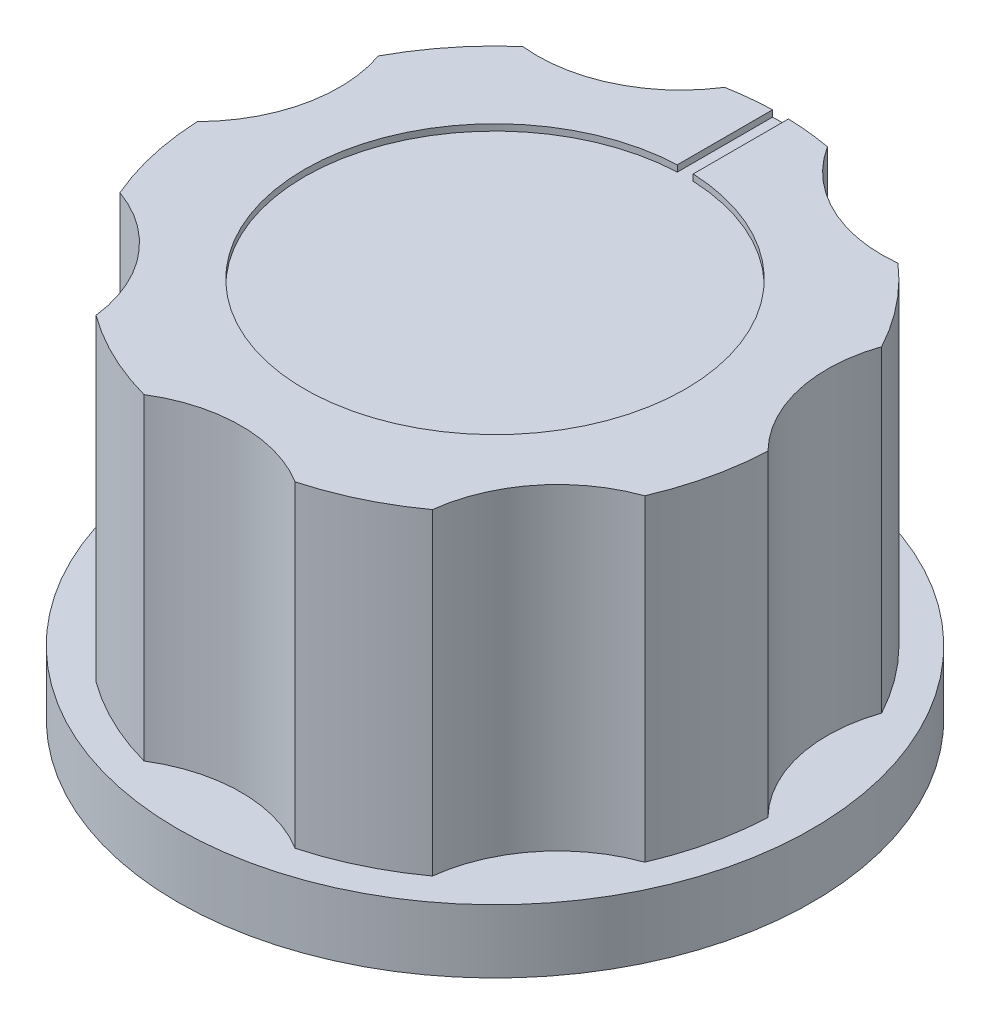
ISO-10303-21;
HEADER;
FILE_DESCRIPTION(('STEP AP214'),'2;1');
FILE_NAME('part.step','',(''),(''),'','','');
FILE_SCHEMA(('AUTOMOTIVE_DESIGN { 1 0 10303 214 1 1 1 1 }'));
ENDSEC;
DATA;
#1=APPLICATION_CONTEXT('core data for automotive mechanical design processes');
#2=APPLICATION_PROTOCOL_DEFINITION('international standard','automotive_design',2000,#1);
#3=PRODUCT_CONTEXT('',#1,'mechanical');
#4=PRODUCT('Part','Part','',(#3));
#5=PRODUCT_RELATED_PRODUCT_CATEGORY('part','',(#4));
#6=PRODUCT_DEFINITION_FORMATION('','',#4);
#7=PRODUCT_DEFINITION_CONTEXT('part definition',#1,'design');
#8=PRODUCT_DEFINITION('design','',#6,#7);
#9=PRODUCT_DEFINITION_SHAPE('','',#8);
#10=(LENGTH_UNIT() NAMED_UNIT(*) SI_UNIT(.MILLI.,.METRE.));
#11=(NAMED_UNIT(*) PLANE_ANGLE_UNIT() SI_UNIT($,.RADIAN.));
#12=(NAMED_UNIT(*) SI_UNIT($,.STERADIAN.) SOLID_ANGLE_UNIT());
#13=UNCERTAINTY_MEASURE_WITH_UNIT(LENGTH_MEASURE(1.E-05),#10,'distance_accuracy_value','');
#14=(GEOMETRIC_REPRESENTATION_CONTEXT(3) GLOBAL_UNCERTAINTY_ASSIGNED_CONTEXT((#13)) GLOBAL_UNIT_ASSIGNED_CONTEXT((#10,
#11,#12)) REPRESENTATION_CONTEXT('',''));
#15=CARTESIAN_POINT('',(0.,0.,0.));
#16=DIRECTION('',(0.,0.,1.));
#17=DIRECTION('',(1.,0.,0.));
#18=AXIS2_PLACEMENT_3D('',#15,#16,#17);
#19=CARTESIAN_POINT('',(10.,2.,0.));
#20=DIRECTION('',(0.,1.,0.));
#21=DIRECTION('',(0.,0.,1.));
#22=AXIS2_PLACEMENT_3D('',#19,#20,#21);
#23=PLANE('',#22);
#24=CARTESIAN_POINT('',(0.,2.,0.));
#25=DIRECTION('',(0.,-1.,0.));
#26=DIRECTION('',(0.,0.,-1.));
#27=AXIS2_PLACEMENT_3D('',#24,#25,#26);
#28=CIRCLE('',#27,10.);
#29=CARTESIAN_POINT('',(0.,2.,-10.));
#30=VERTEX_POINT('',#29);
#31=EDGE_CURVE('E11',#30,#30,#28,.T.);
#32=ORIENTED_EDGE('',*,*,#31,.F.);
#33=EDGE_LOOP('',(#32));
#34=FACE_BOUND('',#33,.T.);
#35=CARTESIAN_POINT('',(-5.42751087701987,2.,-11.2747237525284));
#36=DIRECTION('',(0.,-1.,0.));
#37=DIRECTION('',(0.,0.,1.));
#38=AXIS2_PLACEMENT_3D('',#35,#36,#37);
#39=CIRCLE('',#38,4.51351769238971);
#40=CARTESIAN_POINT('',(-1.61852102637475,2.,-8.85326999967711));
#41=VERTEX_POINT('',#40);
#42=CARTESIAN_POINT('',(-5.91057194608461,2.,-6.78713041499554));
#43=VERTEX_POINT('',#42);
#44=EDGE_CURVE('E220',#41,#43,#39,.T.);
#45=ORIENTED_EDGE('',*,*,#44,.F.);
#46=CARTESIAN_POINT('',(0.,2.,0.));
#47=DIRECTION('',(0.,1.,0.));
#48=DIRECTION('',(0.,0.,-1.));
#49=AXIS2_PLACEMENT_3D('',#46,#47,#48);
#50=CIRCLE('',#49,9.);
#51=CARTESIAN_POINT('',(1.6221993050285,2.,-8.85259676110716));
#52=VERTEX_POINT('',#51);
#53=EDGE_CURVE('E217',#52,#41,#50,.T.);
#54=ORIENTED_EDGE('',*,*,#53,.F.);
#55=CARTESIAN_POINT('',(5.43131281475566,2.,-11.2738559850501));
#56=DIRECTION('',(0.,-1.,0.));
#57=DIRECTION('',(0.,0.,1.));
#58=AXIS2_PLACEMENT_3D('',#55,#56,#57);
#59=CIRCLE('',#58,4.51351769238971);
#60=CARTESIAN_POINT('',(5.91187609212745,2.,-6.78599447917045));
#61=VERTEX_POINT('',#60);
#62=EDGE_CURVE('E245',#61,#52,#59,.T.);
#63=ORIENTED_EDGE('',*,*,#62,.F.);
#64=CARTESIAN_POINT('',(0.,2.,0.));
#65=DIRECTION('',(0.,1.,0.));
#66=DIRECTION('',(0.,0.,-1.));
#67=AXIS2_PLACEMENT_3D('',#64,#65,#66);
#68=CIRCLE('',#67,9.);
#69=CARTESIAN_POINT('',(7.93272911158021,2.,-4.25109501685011));
#70=VERTEX_POINT('',#69);
#71=EDGE_CURVE('E243',#70,#61,#68,.T.);
#72=ORIENTED_EDGE('',*,*,#71,.F.);
#73=CARTESIAN_POINT('',(12.2010001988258,2.,-2.78354471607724));
#74=DIRECTION('',(0.,-1.,0.));
#75=DIRECTION('',(0.,0.,1.));
#76=AXIS2_PLACEMENT_3D('',#73,#74,#75);
#77=CIRCLE('',#76,4.51351769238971);
#78=CARTESIAN_POINT('',(8.99154694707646,2.,0.389978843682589));
#79=VERTEX_POINT('',#78);
#80=EDGE_CURVE('E241',#79,#70,#77,.T.);
#81=ORIENTED_EDGE('',*,*,#80,.F.);
#82=CARTESIAN_POINT('',(0.,2.,0.));
#83=DIRECTION('',(0.,1.,0.));
#84=DIRECTION('',(0.,0.,-1.));
#85=AXIS2_PLACEMENT_3D('',#82,#83,#84);
#86=CIRCLE('',#85,9.);
#87=CARTESIAN_POINT('',(8.26994399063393,2.,3.55077827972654));
#88=VERTEX_POINT('',#87);
#89=EDGE_CURVE('E239',#88,#79,#86,.T.);
#90=ORIENTED_EDGE('',*,*,#89,.F.);
#91=CARTESIAN_POINT('',(9.78383859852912,2.,7.80283249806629));
#92=DIRECTION('',(0.,-1.,0.));
#93=DIRECTION('',(0.,0.,1.));
#94=AXIS2_PLACEMENT_3D('',#91,#92,#93);
#95=CIRCLE('',#94,4.51351769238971);
#96=CARTESIAN_POINT('',(5.30155090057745,2.,7.27279575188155));
#97=VERTEX_POINT('',#96);
#98=EDGE_CURVE('E237',#97,#88,#95,.T.);
#99=ORIENTED_EDGE('',*,*,#98,.F.);
#100=CARTESIAN_POINT('',(0.,2.,0.));
#101=DIRECTION('',(0.,1.,0.));
#102=DIRECTION('',(0.,0.,-1.));
#103=AXIS2_PLACEMENT_3D('',#100,#101,#102);
#104=CIRCLE('',#103,9.);
#105=CARTESIAN_POINT('',(2.38125,2.,8.67926543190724));
#106=VERTEX_POINT('',#105);
#107=EDGE_CURVE('E235',#106,#97,#104,.T.);
#108=ORIENTED_EDGE('',*,*,#107,.F.);
#109=CARTESIAN_POINT('',(0.,2.,12.5135176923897));
#110=DIRECTION('',(0.,-1.,0.));
#111=DIRECTION('',(0.,0.,1.));
#112=AXIS2_PLACEMENT_3D('',#109,#110,#111);
#113=CIRCLE('',#112,4.51351769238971);
#114=CARTESIAN_POINT('',(-2.38125,2.,8.67926543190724));
#115=VERTEX_POINT('',#114);
#116=EDGE_CURVE('E233',#115,#106,#113,.T.);
#117=ORIENTED_EDGE('',*,*,#116,.F.);
#118=CARTESIAN_POINT('',(0.,2.,0.));
#119=DIRECTION('',(0.,1.,0.));
#120=DIRECTION('',(0.,0.,-1.));
#121=AXIS2_PLACEMENT_3D('',#118,#119,#120);
#122=CIRCLE('',#121,9.);
#123=CARTESIAN_POINT('',(-5.30052517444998,2.,7.27354335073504));
#124=VERTEX_POINT('',#123);
#125=EDGE_CURVE('E231',#124,#115,#122,.T.);
#126=ORIENTED_EDGE('',*,*,#125,.F.);
#127=CARTESIAN_POINT('',(-9.78308557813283,2.,7.80126883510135));
#128=DIRECTION('',(0.,-1.,0.));
#129=DIRECTION('',(0.,0.,1.));
#130=AXIS2_PLACEMENT_3D('',#127,#128,#129);
#131=CIRCLE('',#130,4.51351769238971);
#132=CARTESIAN_POINT('',(-8.27087181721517,2.,3.5486165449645));
#133=VERTEX_POINT('',#132);
#134=EDGE_CURVE('E229',#133,#124,#131,.T.);
#135=ORIENTED_EDGE('',*,*,#134,.F.);
#136=CARTESIAN_POINT('',(0.,2.,0.));
#137=DIRECTION('',(0.,1.,0.));
#138=DIRECTION('',(0.,0.,-1.));
#139=AXIS2_PLACEMENT_3D('',#136,#137,#138);
#140=CIRCLE('',#139,9.);
#141=CARTESIAN_POINT('',(-8.99152528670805,2.,0.390477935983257));
#142=VERTEX_POINT('',#141);
#143=EDGE_CURVE('E227',#142,#133,#140,.T.);
#144=ORIENTED_EDGE('',*,*,#143,.F.);
#145=CARTESIAN_POINT('',(-12.1985551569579,2.,-2.7854945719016));
#146=DIRECTION('',(0.,-1.,0.));
#147=DIRECTION('',(0.,0.,1.));
#148=AXIS2_PLACEMENT_3D('',#145,#146,#147);
#149=CIRCLE('',#148,4.51351769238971);
#150=CARTESIAN_POINT('',(-7.93083109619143,2.,-4.25463489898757));
#151=VERTEX_POINT('',#150);
#152=EDGE_CURVE('E225',#151,#142,#149,.T.);
#153=ORIENTED_EDGE('',*,*,#152,.F.);
#154=CARTESIAN_POINT('',(0.,2.,0.));
#155=DIRECTION('',(0.,1.,0.));
#156=DIRECTION('',(0.,0.,-1.));
#157=AXIS2_PLACEMENT_3D('',#154,#155,#156);
#158=CIRCLE('',#157,9.);
#159=EDGE_CURVE('E223',#43,#151,#158,.T.);
#160=ORIENTED_EDGE('',*,*,#159,.F.);
#161=EDGE_LOOP('',(#45,#54,#63,#72,#81,#90,#99,#108,#117,#126,#135,#144,#153,#160));
#162=FACE_BOUND('',#161,.T.);
#163=ADVANCED_FACE('F33',(#34,#162),#23,.T.);
#164=CARTESIAN_POINT('',(0.,2.,0.));
#165=DIRECTION('',(0.,-1.,0.));
#166=DIRECTION('',(0.,0.,-1.));
#167=AXIS2_PLACEMENT_3D('',#164,#165,#166);
#168=CYLINDRICAL_SURFACE('',#167,10.);
#169=ORIENTED_EDGE('',*,*,#31,.T.);
#170=EDGE_LOOP('',(#169));
#171=FACE_BOUND('',#170,.T.);
#172=CARTESIAN_POINT('',(0.,0.,0.));
#173=DIRECTION('',(0.,-1.,0.));
#174=DIRECTION('',(0.,0.,-1.));
#175=AXIS2_PLACEMENT_3D('',#172,#173,#174);
#176=CIRCLE('',#175,10.);
#177=CARTESIAN_POINT('',(0.,0.,-10.));
#178=VERTEX_POINT('',#177);
#179=EDGE_CURVE('E41',#178,#178,#176,.T.);
#180=ORIENTED_EDGE('',*,*,#179,.F.);
#181=EDGE_LOOP('',(#180));
#182=FACE_BOUND('',#181,.T.);
#183=ADVANCED_FACE('F35',(#171,#182),#168,.T.);
#184=CARTESIAN_POINT('',(0.,0.,0.));
#185=DIRECTION('',(0.,-1.,0.));
#186=DIRECTION('',(0.,0.,-1.));
#187=AXIS2_PLACEMENT_3D('',#184,#185,#186);
#188=PLANE('',#187);
#189=CARTESIAN_POINT('',(0.,0.,0.));
#190=DIRECTION('',(0.,-1.,0.));
#191=DIRECTION('',(0.,0.,-1.));
#192=AXIS2_PLACEMENT_3D('',#189,#190,#191);
#193=CIRCLE('',#192,6.5);
#194=CARTESIAN_POINT('',(0.,0.,-6.5));
#195=VERTEX_POINT('',#194);
#196=EDGE_CURVE('E567',#195,#195,#193,.T.);
#197=ORIENTED_EDGE('',*,*,#196,.F.);
#198=EDGE_LOOP('',(#197));
#199=FACE_BOUND('',#198,.T.);
#200=ORIENTED_EDGE('',*,*,#179,.T.);
#201=EDGE_LOOP('',(#200));
#202=FACE_BOUND('',#201,.T.);
#203=ADVANCED_FACE('F287',(#199,#202),#188,.T.);
#204=CARTESIAN_POINT('',(0.,12.,0.));
#205=DIRECTION('',(0.,-1.,0.));
#206=DIRECTION('',(0.,0.,-1.));
#207=AXIS2_PLACEMENT_3D('',#204,#205,#206);
#208=CYLINDRICAL_SURFACE('',#207,9.);
#209=CARTESIAN_POINT('',(0.,11.8,0.));
#210=DIRECTION('',(0.,1.,0.));
#211=DIRECTION('',(0.,0.,1.));
#212=AXIS2_PLACEMENT_3D('',#209,#210,#211);
#213=CIRCLE('',#212,9.);
#214=CARTESIAN_POINT('',(0.249999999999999,11.8,-8.99652710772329));
#215=VERTEX_POINT('',#214);
#216=CARTESIAN_POINT('',(-0.25,11.8,-8.99652710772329));
#217=VERTEX_POINT('',#216);
#218=EDGE_CURVE('E166',#215,#217,#213,.T.);
#219=ORIENTED_EDGE('',*,*,#218,.F.);
#220=DIRECTION('',(0.,1.,0.));
#221=VECTOR('',#220,1.);
#222=CARTESIAN_POINT('',(0.249999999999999,11.8,-8.99652710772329));
#223=LINE('',#222,#221);
#224=CARTESIAN_POINT('',(0.249999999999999,12.,-8.99652710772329));
#225=VERTEX_POINT('',#224);
#226=EDGE_CURVE('E221',#215,#225,#223,.T.);
#227=ORIENTED_EDGE('',*,*,#226,.T.);
#228=CARTESIAN_POINT('',(0.,12.,0.));
#229=DIRECTION('',(0.,1.,0.));
#230=DIRECTION('',(0.,0.,-1.));
#231=AXIS2_PLACEMENT_3D('',#228,#229,#230);
#232=CIRCLE('',#231,9.);
#233=CARTESIAN_POINT('',(1.6221993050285,12.,-8.85259676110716));
#234=VERTEX_POINT('',#233);
#235=EDGE_CURVE('E187',#234,#225,#232,.T.);
#236=ORIENTED_EDGE('',*,*,#235,.F.);
#237=DIRECTION('',(0.,-1.,0.));
#238=VECTOR('',#237,1.);
#239=CARTESIAN_POINT('',(1.6221993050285,12.,-8.85259676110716));
#240=LINE('',#239,#238);
#241=EDGE_CURVE('E216',#234,#52,#240,.T.);
#242=ORIENTED_EDGE('',*,*,#241,.T.);
#243=ORIENTED_EDGE('',*,*,#53,.T.);
#244=DIRECTION('',(0.,-1.,0.));
#245=VECTOR('',#244,1.);
#246=CARTESIAN_POINT('',(-1.61852102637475,12.,-8.85326999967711));
#247=LINE('',#246,#245);
#248=CARTESIAN_POINT('',(-1.61852102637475,12.,-8.85326999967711));
#249=VERTEX_POINT('',#248);
#250=EDGE_CURVE('E283',#249,#41,#247,.T.);
#251=ORIENTED_EDGE('',*,*,#250,.F.);
#252=CARTESIAN_POINT('',(-0.25,12.,-8.99652710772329));
#253=VERTEX_POINT('',#252);
#254=EDGE_CURVE('E180',#253,#249,#232,.T.);
#255=ORIENTED_EDGE('',*,*,#254,.F.);
#256=DIRECTION('',(0.,1.,0.));
#257=VECTOR('',#256,1.);
#258=CARTESIAN_POINT('',(-0.25,11.8,-8.99652710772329));
#259=LINE('',#258,#257);
#260=EDGE_CURVE('E48',#217,#253,#259,.T.);
#261=ORIENTED_EDGE('',*,*,#260,.F.);
#262=EDGE_LOOP('',(#219,#227,#236,#242,#243,#251,#255,#261));
#263=FACE_BOUND('',#262,.T.);
#264=ADVANCED_FACE('F178',(#263),#208,.T.);
#265=CARTESIAN_POINT('',(-5.42751087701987,12.,-11.2747237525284));
#266=DIRECTION('',(0.,-1.,0.));
#267=DIRECTION('',(0.,0.,-1.));
#268=AXIS2_PLACEMENT_3D('',#265,#266,#267);
#269=CYLINDRICAL_SURFACE('',#268,4.51351769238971);
#270=ORIENTED_EDGE('',*,*,#44,.T.);
#271=DIRECTION('',(0.,-1.,0.));
#272=VECTOR('',#271,1.);
#273=CARTESIAN_POINT('',(-5.91057194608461,12.,-6.78713041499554));
#274=LINE('',#273,#272);
#275=CARTESIAN_POINT('',(-5.91057194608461,12.,-6.78713041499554));
#276=VERTEX_POINT('',#275);
#277=EDGE_CURVE('E280',#276,#43,#274,.T.);
#278=ORIENTED_EDGE('',*,*,#277,.F.);
#279=CARTESIAN_POINT('',(-5.42751087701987,12.,-11.2747237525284));
#280=DIRECTION('',(0.,-1.,0.));
#281=DIRECTION('',(0.,0.,1.));
#282=AXIS2_PLACEMENT_3D('',#279,#280,#281);
#283=CIRCLE('',#282,4.51351769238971);
#284=EDGE_CURVE('E190',#249,#276,#283,.T.);
#285=ORIENTED_EDGE('',*,*,#284,.F.);
#286=ORIENTED_EDGE('',*,*,#250,.T.);
#287=EDGE_LOOP('',(#270,#278,#285,#286));
#288=FACE_BOUND('',#287,.T.);
#289=ADVANCED_FACE('F307',(#288),#269,.F.);
#290=CARTESIAN_POINT('',(0.,12.,0.));
#291=DIRECTION('',(0.,-1.,0.));
#292=DIRECTION('',(0.,0.,-1.));
#293=AXIS2_PLACEMENT_3D('',#290,#291,#292);
#294=CYLINDRICAL_SURFACE('',#293,9.);
#295=ORIENTED_EDGE('',*,*,#159,.T.);
#296=DIRECTION('',(0.,-1.,0.));
#297=VECTOR('',#296,1.);
#298=CARTESIAN_POINT('',(-7.93083109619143,12.,-4.25463489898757));
#299=LINE('',#298,#297);
#300=CARTESIAN_POINT('',(-7.93083109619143,12.,-4.25463489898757));
#301=VERTEX_POINT('',#300);
#302=EDGE_CURVE('E277',#301,#151,#299,.T.);
#303=ORIENTED_EDGE('',*,*,#302,.F.);
#304=CARTESIAN_POINT('',(0.,12.,0.));
#305=DIRECTION('',(0.,1.,0.));
#306=DIRECTION('',(0.,0.,-1.));
#307=AXIS2_PLACEMENT_3D('',#304,#305,#306);
#308=CIRCLE('',#307,9.);
#309=EDGE_CURVE('E192',#276,#301,#308,.T.);
#310=ORIENTED_EDGE('',*,*,#309,.F.);
#311=ORIENTED_EDGE('',*,*,#277,.T.);
#312=EDGE_LOOP('',(#295,#303,#310,#311));
#313=FACE_BOUND('',#312,.T.);
#314=ADVANCED_FACE('F311',(#313),#294,.T.);
#315=CARTESIAN_POINT('',(-12.1985551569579,12.,-2.7854945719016));
#316=DIRECTION('',(0.,-1.,0.));
#317=DIRECTION('',(0.,0.,-1.));
#318=AXIS2_PLACEMENT_3D('',#315,#316,#317);
#319=CYLINDRICAL_SURFACE('',#318,4.51351769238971);
#320=ORIENTED_EDGE('',*,*,#152,.T.);
#321=DIRECTION('',(0.,-1.,0.));
#322=VECTOR('',#321,1.);
#323=CARTESIAN_POINT('',(-8.99152528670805,12.,0.390477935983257));
#324=LINE('',#323,#322);
#325=CARTESIAN_POINT('',(-8.99152528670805,12.,0.390477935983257));
#326=VERTEX_POINT('',#325);
#327=EDGE_CURVE('E274',#326,#142,#324,.T.);
#328=ORIENTED_EDGE('',*,*,#327,.F.);
#329=CARTESIAN_POINT('',(-12.1985551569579,12.,-2.7854945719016));
#330=DIRECTION('',(0.,-1.,0.));
#331=DIRECTION('',(0.,0.,1.));
#332=AXIS2_PLACEMENT_3D('',#329,#330,#331);
#333=CIRCLE('',#332,4.51351769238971);
#334=EDGE_CURVE('E194',#301,#326,#333,.T.);
#335=ORIENTED_EDGE('',*,*,#334,.F.);
#336=ORIENTED_EDGE('',*,*,#302,.T.);
#337=EDGE_LOOP('',(#320,#328,#335,#336));
#338=FACE_BOUND('',#337,.T.);
#339=ADVANCED_FACE('F365',(#338),#319,.F.);
#340=CARTESIAN_POINT('',(0.,12.,0.));
#341=DIRECTION('',(0.,-1.,0.));
#342=DIRECTION('',(0.,0.,-1.));
#343=AXIS2_PLACEMENT_3D('',#340,#341,#342);
#344=CYLINDRICAL_SURFACE('',#343,9.);
#345=ORIENTED_EDGE('',*,*,#143,.T.);
#346=DIRECTION('',(0.,-1.,0.));
#347=VECTOR('',#346,1.);
#348=CARTESIAN_POINT('',(-8.27087181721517,12.,3.5486165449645));
#349=LINE('',#348,#347);
#350=CARTESIAN_POINT('',(-8.27087181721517,12.,3.5486165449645));
#351=VERTEX_POINT('',#350);
#352=EDGE_CURVE('E271',#351,#133,#349,.T.);
#353=ORIENTED_EDGE('',*,*,#352,.F.);
#354=CARTESIAN_POINT('',(0.,12.,0.));
#355=DIRECTION('',(0.,1.,0.));
#356=DIRECTION('',(0.,0.,-1.));
#357=AXIS2_PLACEMENT_3D('',#354,#355,#356);
#358=CIRCLE('',#357,9.);
#359=EDGE_CURVE('E196',#326,#351,#358,.T.);
#360=ORIENTED_EDGE('',*,*,#359,.F.);
#361=ORIENTED_EDGE('',*,*,#327,.T.);
#362=EDGE_LOOP('',(#345,#353,#360,#361));
#363=FACE_BOUND('',#362,.T.);
#364=ADVANCED_FACE('F363',(#363),#344,.T.);
#365=CARTESIAN_POINT('',(-9.78308557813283,12.,7.80126883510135));
#366=DIRECTION('',(0.,-1.,0.));
#367=DIRECTION('',(0.,0.,-1.));
#368=AXIS2_PLACEMENT_3D('',#365,#366,#367);
#369=CYLINDRICAL_SURFACE('',#368,4.51351769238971);
#370=ORIENTED_EDGE('',*,*,#134,.T.);
#371=DIRECTION('',(0.,-1.,0.));
#372=VECTOR('',#371,1.);
#373=CARTESIAN_POINT('',(-5.30052517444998,12.,7.27354335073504));
#374=LINE('',#373,#372);
#375=CARTESIAN_POINT('',(-5.30052517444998,12.,7.27354335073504));
#376=VERTEX_POINT('',#375);
#377=EDGE_CURVE('E268',#376,#124,#374,.T.);
#378=ORIENTED_EDGE('',*,*,#377,.F.);
#379=CARTESIAN_POINT('',(-9.78308557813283,12.,7.80126883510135));
#380=DIRECTION('',(0.,-1.,0.));
#381=DIRECTION('',(0.,0.,1.));
#382=AXIS2_PLACEMENT_3D('',#379,#380,#381);
#383=CIRCLE('',#382,4.51351769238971);
#384=EDGE_CURVE('E198',#351,#376,#383,.T.);
#385=ORIENTED_EDGE('',*,*,#384,.F.);
#386=ORIENTED_EDGE('',*,*,#352,.T.);
#387=EDGE_LOOP('',(#370,#378,#385,#386));
#388=FACE_BOUND('',#387,.T.);
#389=ADVANCED_FACE('F359',(#388),#369,.F.);
#390=CARTESIAN_POINT('',(0.,12.,0.));
#391=DIRECTION('',(0.,-1.,0.));
#392=DIRECTION('',(0.,0.,-1.));
#393=AXIS2_PLACEMENT_3D('',#390,#391,#392);
#394=CYLINDRICAL_SURFACE('',#393,9.);
#395=ORIENTED_EDGE('',*,*,#125,.T.);
#396=DIRECTION('',(0.,-1.,0.));
#397=VECTOR('',#396,1.);
#398=CARTESIAN_POINT('',(-2.38125,12.,8.67926543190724));
#399=LINE('',#398,#397);
#400=CARTESIAN_POINT('',(-2.38125,12.,8.67926543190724));
#401=VERTEX_POINT('',#400);
#402=EDGE_CURVE('E265',#401,#115,#399,.T.);
#403=ORIENTED_EDGE('',*,*,#402,.F.);
#404=CARTESIAN_POINT('',(0.,12.,0.));
#405=DIRECTION('',(0.,1.,0.));
#406=DIRECTION('',(0.,0.,-1.));
#407=AXIS2_PLACEMENT_3D('',#404,#405,#406);
#408=CIRCLE('',#407,9.);
#409=EDGE_CURVE('E200',#376,#401,#408,.T.);
#410=ORIENTED_EDGE('',*,*,#409,.F.);
#411=ORIENTED_EDGE('',*,*,#377,.T.);
#412=EDGE_LOOP('',(#395,#403,#410,#411));
#413=FACE_BOUND('',#412,.T.);
#414=ADVANCED_FACE('F354',(#413),#394,.T.);
#415=CARTESIAN_POINT('',(0.,12.,12.5135176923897));
#416=DIRECTION('',(0.,-1.,0.));
#417=DIRECTION('',(0.,0.,-1.));
#418=AXIS2_PLACEMENT_3D('',#415,#416,#417);
#419=CYLINDRICAL_SURFACE('',#418,4.51351769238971);
#420=ORIENTED_EDGE('',*,*,#116,.T.);
#421=DIRECTION('',(0.,-1.,0.));
#422=VECTOR('',#421,1.);
#423=CARTESIAN_POINT('',(2.38125,12.,8.67926543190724));
#424=LINE('',#423,#422);
#425=CARTESIAN_POINT('',(2.38125,12.,8.67926543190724));
#426=VERTEX_POINT('',#425);
#427=EDGE_CURVE('E262',#426,#106,#424,.T.);
#428=ORIENTED_EDGE('',*,*,#427,.F.);
#429=CARTESIAN_POINT('',(0.,12.,12.5135176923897));
#430=DIRECTION('',(0.,-1.,0.));
#431=DIRECTION('',(0.,0.,1.));
#432=AXIS2_PLACEMENT_3D('',#429,#430,#431);
#433=CIRCLE('',#432,4.51351769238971);
#434=EDGE_CURVE('E202',#401,#426,#433,.T.);
#435=ORIENTED_EDGE('',*,*,#434,.F.);
#436=ORIENTED_EDGE('',*,*,#402,.T.);
#437=EDGE_LOOP('',(#420,#428,#435,#436));
#438=FACE_BOUND('',#437,.T.);
#439=ADVANCED_FACE('F348',(#438),#419,.F.);
#440=CARTESIAN_POINT('',(0.,12.,0.));
#441=DIRECTION('',(0.,-1.,0.));
#442=DIRECTION('',(0.,0.,-1.));
#443=AXIS2_PLACEMENT_3D('',#440,#441,#442);
#444=CYLINDRICAL_SURFACE('',#443,9.);
#445=ORIENTED_EDGE('',*,*,#107,.T.);
#446=DIRECTION('',(0.,-1.,0.));
#447=VECTOR('',#446,1.);
#448=CARTESIAN_POINT('',(5.30155090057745,12.,7.27279575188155));
#449=LINE('',#448,#447);
#450=CARTESIAN_POINT('',(5.30155090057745,12.,7.27279575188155));
#451=VERTEX_POINT('',#450);
#452=EDGE_CURVE('E259',#451,#97,#449,.T.);
#453=ORIENTED_EDGE('',*,*,#452,.F.);
#454=CARTESIAN_POINT('',(0.,12.,0.));
#455=DIRECTION('',(0.,1.,0.));
#456=DIRECTION('',(0.,0.,-1.));
#457=AXIS2_PLACEMENT_3D('',#454,#455,#456);
#458=CIRCLE('',#457,9.);
#459=EDGE_CURVE('E204',#426,#451,#458,.T.);
#460=ORIENTED_EDGE('',*,*,#459,.F.);
#461=ORIENTED_EDGE('',*,*,#427,.T.);
#462=EDGE_LOOP('',(#445,#453,#460,#461));
#463=FACE_BOUND('',#462,.T.);
#464=ADVANCED_FACE('F344',(#463),#444,.T.);
#465=CARTESIAN_POINT('',(9.78383859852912,12.,7.80283249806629));
#466=DIRECTION('',(0.,-1.,0.));
#467=DIRECTION('',(0.,0.,-1.));
#468=AXIS2_PLACEMENT_3D('',#465,#466,#467);
#469=CYLINDRICAL_SURFACE('',#468,4.51351769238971);
#470=ORIENTED_EDGE('',*,*,#98,.T.);
#471=DIRECTION('',(0.,-1.,0.));
#472=VECTOR('',#471,1.);
#473=CARTESIAN_POINT('',(8.26994399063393,12.,3.55077827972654));
#474=LINE('',#473,#472);
#475=CARTESIAN_POINT('',(8.26994399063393,12.,3.55077827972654));
#476=VERTEX_POINT('',#475);
#477=EDGE_CURVE('E256',#476,#88,#474,.T.);
#478=ORIENTED_EDGE('',*,*,#477,.F.);
#479=CARTESIAN_POINT('',(9.78383859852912,12.,7.80283249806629));
#480=DIRECTION('',(0.,-1.,0.));
#481=DIRECTION('',(0.,0.,1.));
#482=AXIS2_PLACEMENT_3D('',#479,#480,#481);
#483=CIRCLE('',#482,4.51351769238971);
#484=EDGE_CURVE('E206',#451,#476,#483,.T.);
#485=ORIENTED_EDGE('',*,*,#484,.F.);
#486=ORIENTED_EDGE('',*,*,#452,.T.);
#487=EDGE_LOOP('',(#470,#478,#485,#486));
#488=FACE_BOUND('',#487,.T.);
#489=ADVANCED_FACE('F339',(#488),#469,.F.);
#490=CARTESIAN_POINT('',(0.,12.,0.));
#491=DIRECTION('',(0.,-1.,0.));
#492=DIRECTION('',(0.,0.,-1.));
#493=AXIS2_PLACEMENT_3D('',#490,#491,#492);
#494=CYLINDRICAL_SURFACE('',#493,9.);
#495=ORIENTED_EDGE('',*,*,#89,.T.);
#496=DIRECTION('',(0.,-1.,0.));
#497=VECTOR('',#496,1.);
#498=CARTESIAN_POINT('',(8.99154694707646,12.,0.389978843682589));
#499=LINE('',#498,#497);
#500=CARTESIAN_POINT('',(8.99154694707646,12.,0.389978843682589));
#501=VERTEX_POINT('',#500);
#502=EDGE_CURVE('E253',#501,#79,#499,.T.);
#503=ORIENTED_EDGE('',*,*,#502,.F.);
#504=CARTESIAN_POINT('',(0.,12.,0.));
#505=DIRECTION('',(0.,1.,0.));
#506=DIRECTION('',(0.,0.,-1.));
#507=AXIS2_PLACEMENT_3D('',#504,#505,#506);
#508=CIRCLE('',#507,9.);
#509=EDGE_CURVE('E208',#476,#501,#508,.T.);
#510=ORIENTED_EDGE('',*,*,#509,.F.);
#511=ORIENTED_EDGE('',*,*,#477,.T.);
#512=EDGE_LOOP('',(#495,#503,#510,#511));
#513=FACE_BOUND('',#512,.T.);
#514=ADVANCED_FACE('F333',(#513),#494,.T.);
#515=CARTESIAN_POINT('',(12.2010001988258,12.,-2.78354471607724));
#516=DIRECTION('',(0.,-1.,0.));
#517=DIRECTION('',(0.,0.,-1.));
#518=AXIS2_PLACEMENT_3D('',#515,#516,#517);
#519=CYLINDRICAL_SURFACE('',#518,4.51351769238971);
#520=ORIENTED_EDGE('',*,*,#80,.T.);
#521=DIRECTION('',(0.,-1.,0.));
#522=VECTOR('',#521,1.);
#523=CARTESIAN_POINT('',(7.93272911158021,12.,-4.25109501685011));
#524=LINE('',#523,#522);
#525=CARTESIAN_POINT('',(7.93272911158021,12.,-4.25109501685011));
#526=VERTEX_POINT('',#525);
#527=EDGE_CURVE('E250',#526,#70,#524,.T.);
#528=ORIENTED_EDGE('',*,*,#527,.F.);
#529=CARTESIAN_POINT('',(12.2010001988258,12.,-2.78354471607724));
#530=DIRECTION('',(0.,-1.,0.));
#531=DIRECTION('',(0.,0.,1.));
#532=AXIS2_PLACEMENT_3D('',#529,#530,#531);
#533=CIRCLE('',#532,4.51351769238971);
#534=EDGE_CURVE('E210',#501,#526,#533,.T.);
#535=ORIENTED_EDGE('',*,*,#534,.F.);
#536=ORIENTED_EDGE('',*,*,#502,.T.);
#537=EDGE_LOOP('',(#520,#528,#535,#536));
#538=FACE_BOUND('',#537,.T.);
#539=ADVANCED_FACE('F329',(#538),#519,.F.);
#540=CARTESIAN_POINT('',(0.,12.,0.));
#541=DIRECTION('',(0.,-1.,0.));
#542=DIRECTION('',(0.,0.,-1.));
#543=AXIS2_PLACEMENT_3D('',#540,#541,#542);
#544=CYLINDRICAL_SURFACE('',#543,9.);
#545=ORIENTED_EDGE('',*,*,#71,.T.);
#546=DIRECTION('',(0.,-1.,0.));
#547=VECTOR('',#546,1.);
#548=CARTESIAN_POINT('',(5.91187609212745,12.,-6.78599447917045));
#549=LINE('',#548,#547);
#550=CARTESIAN_POINT('',(5.91187609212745,12.,-6.78599447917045));
#551=VERTEX_POINT('',#550);
#552=EDGE_CURVE('E56',#551,#61,#549,.T.);
#553=ORIENTED_EDGE('',*,*,#552,.F.);
#554=CARTESIAN_POINT('',(0.,12.,0.));
#555=DIRECTION('',(0.,1.,0.));
#556=DIRECTION('',(0.,0.,-1.));
#557=AXIS2_PLACEMENT_3D('',#554,#555,#556);
#558=CIRCLE('',#557,9.);
#559=EDGE_CURVE('E212',#526,#551,#558,.T.);
#560=ORIENTED_EDGE('',*,*,#559,.F.);
#561=ORIENTED_EDGE('',*,*,#527,.T.);
#562=EDGE_LOOP('',(#545,#553,#560,#561));
#563=FACE_BOUND('',#562,.T.);
#564=ADVANCED_FACE('F324',(#563),#544,.T.);
#565=CARTESIAN_POINT('',(5.43131281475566,12.,-11.2738559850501));
#566=DIRECTION('',(0.,-1.,0.));
#567=DIRECTION('',(0.,0.,-1.));
#568=AXIS2_PLACEMENT_3D('',#565,#566,#567);
#569=CYLINDRICAL_SURFACE('',#568,4.51351769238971);
#570=ORIENTED_EDGE('',*,*,#62,.T.);
#571=ORIENTED_EDGE('',*,*,#241,.F.);
#572=CARTESIAN_POINT('',(5.43131281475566,12.,-11.2738559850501));
#573=DIRECTION('',(0.,-1.,0.));
#574=DIRECTION('',(0.,0.,1.));
#575=AXIS2_PLACEMENT_3D('',#572,#573,#574);
#576=CIRCLE('',#575,4.51351769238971);
#577=EDGE_CURVE('E214',#551,#234,#576,.T.);
#578=ORIENTED_EDGE('',*,*,#577,.F.);
#579=ORIENTED_EDGE('',*,*,#552,.T.);
#580=EDGE_LOOP('',(#570,#571,#578,#579));
#581=FACE_BOUND('',#580,.T.);
#582=ADVANCED_FACE('F319',(#581),#569,.F.);
#583=CARTESIAN_POINT('',(2.71565640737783,12.,-5.63692799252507));
#584=DIRECTION('',(0.,-1.,0.));
#585=DIRECTION('',(0.,0.,-1.));
#586=AXIS2_PLACEMENT_3D('',#583,#584,#585);
#587=PLANE('',#586);
#588=ORIENTED_EDGE('',*,*,#235,.T.);
#589=DIRECTION('',(0.,0.,-1.));
#590=VECTOR('',#589,1.);
#591=CARTESIAN_POINT('',(0.25,12.,-5.9947894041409));
#592=LINE('',#591,#590);
#593=CARTESIAN_POINT('',(0.250000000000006,12.,-5.9947894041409));
#594=VERTEX_POINT('',#593);
#595=EDGE_CURVE('E175',#594,#225,#592,.T.);
#596=ORIENTED_EDGE('',*,*,#595,.F.);
#597=CARTESIAN_POINT('',(0.,12.,0.));
#598=DIRECTION('',(0.,1.,0.));
#599=DIRECTION('',(0.,0.,1.));
#600=AXIS2_PLACEMENT_3D('',#597,#598,#599);
#601=CIRCLE('',#600,6.);
#602=CARTESIAN_POINT('',(-0.250000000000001,12.,-5.9947894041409));
#603=VERTEX_POINT('',#602);
#604=EDGE_CURVE('E580',#603,#594,#601,.T.);
#605=ORIENTED_EDGE('',*,*,#604,.F.);
#606=DIRECTION('',(0.,0.,1.));
#607=VECTOR('',#606,1.);
#608=CARTESIAN_POINT('',(-0.25,12.,-8.99652710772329));
#609=LINE('',#608,#607);
#610=EDGE_CURVE('E576',#253,#603,#609,.T.);
#611=ORIENTED_EDGE('',*,*,#610,.F.);
#612=ORIENTED_EDGE('',*,*,#254,.T.);
#613=ORIENTED_EDGE('',*,*,#284,.T.);
#614=ORIENTED_EDGE('',*,*,#309,.T.);
#615=ORIENTED_EDGE('',*,*,#334,.T.);
#616=ORIENTED_EDGE('',*,*,#359,.T.);
#617=ORIENTED_EDGE('',*,*,#384,.T.);
#618=ORIENTED_EDGE('',*,*,#409,.T.);
#619=ORIENTED_EDGE('',*,*,#434,.T.);
#620=ORIENTED_EDGE('',*,*,#459,.T.);
#621=ORIENTED_EDGE('',*,*,#484,.T.);
#622=ORIENTED_EDGE('',*,*,#509,.T.);
#623=ORIENTED_EDGE('',*,*,#534,.T.);
#624=ORIENTED_EDGE('',*,*,#559,.T.);
#625=ORIENTED_EDGE('',*,*,#577,.T.);
#626=EDGE_LOOP('',(#588,#596,#605,#611,#612,#613,#614,#615,#616,#617,#618,#619,#620,#621,#622,
#623,#624,#625));
#627=FACE_BOUND('',#626,.T.);
#628=ADVANCED_FACE('F315',(#627),#587,.F.);
#629=CARTESIAN_POINT('',(0.25,11.8,-5.9947894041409));
#630=DIRECTION('',(1.,0.,0.));
#631=DIRECTION('',(0.,0.,-1.));
#632=AXIS2_PLACEMENT_3D('',#629,#630,#631);
#633=PLANE('',#632);
#634=ORIENTED_EDGE('',*,*,#595,.T.);
#635=ORIENTED_EDGE('',*,*,#226,.F.);
#636=DIRECTION('',(0.,0.,-1.));
#637=VECTOR('',#636,1.);
#638=CARTESIAN_POINT('',(0.25,11.8,-5.9947894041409));
#639=LINE('',#638,#637);
#640=CARTESIAN_POINT('',(0.250000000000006,11.8,-5.9947894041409));
#641=VERTEX_POINT('',#640);
#642=EDGE_CURVE('E172',#641,#215,#639,.T.);
#643=ORIENTED_EDGE('',*,*,#642,.F.);
#644=DIRECTION('',(0.,1.,0.));
#645=VECTOR('',#644,1.);
#646=CARTESIAN_POINT('',(0.250000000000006,11.8,-5.9947894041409));
#647=LINE('',#646,#645);
#648=EDGE_CURVE('E182',#641,#594,#647,.T.);
#649=ORIENTED_EDGE('',*,*,#648,.T.);
#650=EDGE_LOOP('',(#634,#635,#643,#649));
#651=FACE_BOUND('',#650,.T.);
#652=ADVANCED_FACE('F482',(#651),#633,.F.);
#653=CARTESIAN_POINT('',(0.,11.8,0.));
#654=DIRECTION('',(0.,1.,0.));
#655=DIRECTION('',(0.,0.,1.));
#656=AXIS2_PLACEMENT_3D('',#653,#654,#655);
#657=CYLINDRICAL_SURFACE('',#656,6.);
#658=ORIENTED_EDGE('',*,*,#604,.T.);
#659=ORIENTED_EDGE('',*,*,#648,.F.);
#660=CARTESIAN_POINT('',(0.,11.8,0.));
#661=DIRECTION('',(0.,1.,0.));
#662=DIRECTION('',(0.,0.,1.));
#663=AXIS2_PLACEMENT_3D('',#660,#661,#662);
#664=CIRCLE('',#663,6.);
#665=CARTESIAN_POINT('',(-0.250000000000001,11.8,-5.9947894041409));
#666=VERTEX_POINT('',#665);
#667=EDGE_CURVE('E165',#666,#641,#664,.T.);
#668=ORIENTED_EDGE('',*,*,#667,.F.);
#669=DIRECTION('',(0.,1.,0.));
#670=VECTOR('',#669,1.);
#671=CARTESIAN_POINT('',(-0.250000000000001,11.8,-5.9947894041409));
#672=LINE('',#671,#670);
#673=EDGE_CURVE('E161',#666,#603,#672,.T.);
#674=ORIENTED_EDGE('',*,*,#673,.T.);
#675=EDGE_LOOP('',(#658,#659,#668,#674));
#676=FACE_BOUND('',#675,.T.);
#677=ADVANCED_FACE('F488',(#676),#657,.F.);
#678=CARTESIAN_POINT('',(-0.25,11.8,-8.99652710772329));
#679=DIRECTION('',(-1.,0.,0.));
#680=DIRECTION('',(0.,0.,1.));
#681=AXIS2_PLACEMENT_3D('',#678,#679,#680);
#682=PLANE('',#681);
#683=ORIENTED_EDGE('',*,*,#610,.T.);
#684=ORIENTED_EDGE('',*,*,#673,.F.);
#685=DIRECTION('',(0.,0.,1.));
#686=VECTOR('',#685,1.);
#687=CARTESIAN_POINT('',(-0.25,11.8,-8.99652710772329));
#688=LINE('',#687,#686);
#689=EDGE_CURVE('E158',#217,#666,#688,.T.);
#690=ORIENTED_EDGE('',*,*,#689,.F.);
#691=ORIENTED_EDGE('',*,*,#260,.T.);
#692=EDGE_LOOP('',(#683,#684,#690,#691));
#693=FACE_BOUND('',#692,.T.);
#694=ADVANCED_FACE('F160',(#693),#682,.F.);
#695=CARTESIAN_POINT('',(0.,11.8,0.));
#696=DIRECTION('',(0.,1.,0.));
#697=DIRECTION('',(0.,0.,1.));
#698=AXIS2_PLACEMENT_3D('',#695,#696,#697);
#699=PLANE('',#698);
#700=ORIENTED_EDGE('',*,*,#218,.T.);
#701=ORIENTED_EDGE('',*,*,#689,.T.);
#702=ORIENTED_EDGE('',*,*,#667,.T.);
#703=ORIENTED_EDGE('',*,*,#642,.T.);
#704=EDGE_LOOP('',(#700,#701,#702,#703));
#705=FACE_BOUND('',#704,.T.);
#706=ADVANCED_FACE('F170',(#705),#699,.T.);
#707=CARTESIAN_POINT('',(0.,11.,0.));
#708=DIRECTION('',(0.,1.,0.));
#709=DIRECTION('',(0.,0.,1.));
#710=AXIS2_PLACEMENT_3D('',#707,#708,#709);
#711=PLANE('',#710);
#712=CARTESIAN_POINT('',(0.,11.,0.));
#713=DIRECTION('',(0.,-1.,0.));
#714=DIRECTION('',(0.,0.,-1.));
#715=AXIS2_PLACEMENT_3D('',#712,#713,#714);
#716=CIRCLE('',#715,3.5);
#717=CARTESIAN_POINT('',(0.,11.,-3.5));
#718=VERTEX_POINT('',#717);
#719=EDGE_CURVE('E574',#718,#718,#716,.T.);
#720=ORIENTED_EDGE('',*,*,#719,.T.);
#721=EDGE_LOOP('',(#720));
#722=FACE_BOUND('',#721,.T.);
#723=ADVANCED_FACE('F509',(#722),#711,.F.);
#724=CARTESIAN_POINT('',(0.,0.,0.));
#725=DIRECTION('',(0.,-1.,0.));
#726=DIRECTION('',(0.,0.,-1.));
#727=AXIS2_PLACEMENT_3D('',#724,#725,#726);
#728=CYLINDRICAL_SURFACE('',#727,3.5);
#729=ORIENTED_EDGE('',*,*,#719,.F.);
#730=EDGE_LOOP('',(#729));
#731=FACE_BOUND('',#730,.T.);
#732=CARTESIAN_POINT('',(0.,2.,0.));
#733=DIRECTION('',(0.,-1.,0.));
#734=DIRECTION('',(0.,0.,-1.));
#735=AXIS2_PLACEMENT_3D('',#732,#733,#734);
#736=CIRCLE('',#735,3.5);
#737=CARTESIAN_POINT('',(0.,2.,-3.5));
#738=VERTEX_POINT('',#737);
#739=EDGE_CURVE('E569',#738,#738,#736,.T.);
#740=ORIENTED_EDGE('',*,*,#739,.T.);
#741=EDGE_LOOP('',(#740));
#742=FACE_BOUND('',#741,.T.);
#743=ADVANCED_FACE('F516',(#731,#742),#728,.F.);
#744=CARTESIAN_POINT('',(3.5,2.,0.));
#745=DIRECTION('',(0.,1.,0.));
#746=DIRECTION('',(0.,0.,1.));
#747=AXIS2_PLACEMENT_3D('',#744,#745,#746);
#748=PLANE('',#747);
#749=ORIENTED_EDGE('',*,*,#739,.F.);
#750=EDGE_LOOP('',(#749));
#751=FACE_BOUND('',#750,.T.);
#752=CARTESIAN_POINT('',(0.,2.,0.));
#753=DIRECTION('',(0.,-1.,0.));
#754=DIRECTION('',(0.,0.,-1.));
#755=AXIS2_PLACEMENT_3D('',#752,#753,#754);
#756=CIRCLE('',#755,6.5);
#757=CARTESIAN_POINT('',(0.,2.,-6.5));
#758=VERTEX_POINT('',#757);
#759=EDGE_CURVE('E564',#758,#758,#756,.T.);
#760=ORIENTED_EDGE('',*,*,#759,.T.);
#761=EDGE_LOOP('',(#760));
#762=FACE_BOUND('',#761,.T.);
#763=ADVANCED_FACE('F524',(#751,#762),#748,.F.);
#764=CARTESIAN_POINT('',(0.,0.,0.));
#765=DIRECTION('',(0.,-1.,0.));
#766=DIRECTION('',(0.,0.,-1.));
#767=AXIS2_PLACEMENT_3D('',#764,#765,#766);
#768=CYLINDRICAL_SURFACE('',#767,6.5);
#769=ORIENTED_EDGE('',*,*,#759,.F.);
#770=EDGE_LOOP('',(#769));
#771=FACE_BOUND('',#770,.T.);
#772=ORIENTED_EDGE('',*,*,#196,.T.);
#773=EDGE_LOOP('',(#772));
#774=FACE_BOUND('',#773,.T.);
#775=ADVANCED_FACE('F532',(#771,#774),#768,.F.);
#776=CLOSED_SHELL('',(#163,#183,#203,#264,#289,#314,#339,#364,#389,#414,#439,#464,#489,#514,
#539,#564,#582,#628,#652,#677,#694,#706,#723,#743,#763,#775));
#777=MANIFOLD_SOLID_BREP('B2',#776);
#778=ADVANCED_BREP_SHAPE_REPRESENTATION('',(#18,#777),#14);
#779=SHAPE_DEFINITION_REPRESENTATION(#9,#778);
ENDSEC;
END-ISO-10303-21;
